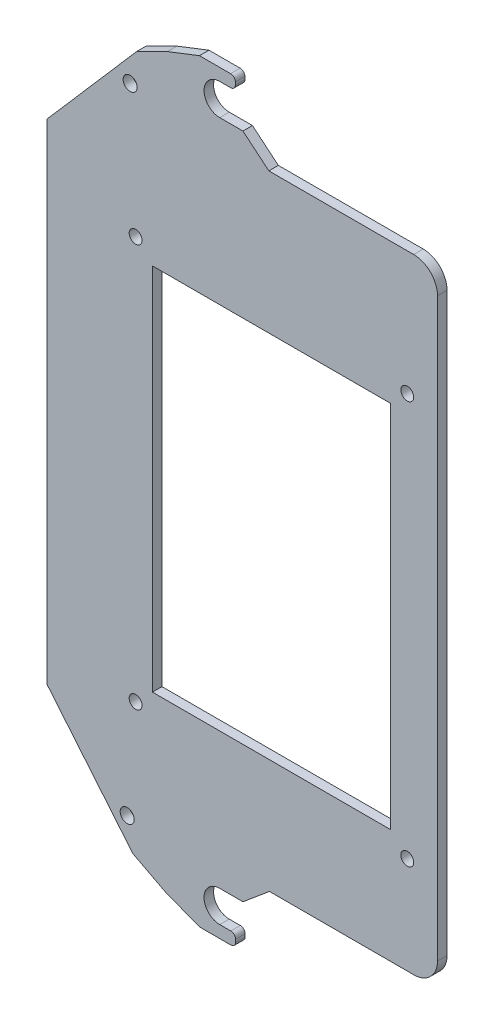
from build123d import *

# Parameters (mm, degrees)
SKETCH1_R           = 1.5
BOSS_EXTRUDE1_DEPTH = 2.032
SKETCH2_R           = 1.375000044
SKETCH2_W           = 24.212268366
SKETCH2_H           = 140.086111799
SKETCH2_W_2         = 50.815795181
SKETCH2_H_2         = 78.815795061
CUT_EXTRUDE1_DEPTH  = 2.032
FILLET1_R           = 5.08
FILLET2_R           = 5.08
FILLET3_R           = 1.016
FILLET4_R           = 1.016
FILLET5_R           = 1.016
FILLET6_R           = 1.016


with BuildPart() as part:
    # Sketch1 → Boss-Extrude1 (new body)
    with BuildSketch(Plane.XY):
        with BuildLine():
            Line((10876.797630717, 3497.975943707), (10882.323986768, 3493.3734144))
            Line((10882.323986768, 3493.3734144), (10939.970073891, 3493.3734144))
            Line((10939.970073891, 3493.3734144), (10939.970073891, 3360.1918064))
            Line((10939.970073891, 3360.1918064), (10882.455998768, 3360.1918064))
            Line((10882.455998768, 3360.1918064), (10876.797630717, 3355.460396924))
            Line((10876.797630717, 3355.460396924), (10871.835598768, 3355.456258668))
            ThreePointArc((10871.835598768, 3355.456258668), (10868.489142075, 3352.109801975), (10871.835598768, 3348.763345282))
            Line((10871.835598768, 3348.763345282), (10875.239912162, 3348.763345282))
            Line((10875.239912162, 3348.763345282), (10875.239912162, 3346.164921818))
            Line((10875.239912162, 3346.164921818), (10867.511043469, 3346.164921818))
            Line((10867.511043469, 3346.164921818), (10860.222293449, 3348.994002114))
            Line((10860.222293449, 3348.994002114), (10853.278243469, 3352.619292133))
            Line((10853.278243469, 3352.619292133), (10834.952955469, 3374.757680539))
            Line((10834.952955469, 3374.757680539), (10834.952955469, 3479.264804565))
            Line((10834.952955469, 3479.264804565), (10854.100493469, 3501.331022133))
            Line((10854.100493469, 3501.331022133), (10854.115043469, 3501.342792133))
            Line((10854.115043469, 3501.342792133), (10860.667528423, 3504.603768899))
            Line((10860.667528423, 3504.603768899), (10867.511043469, 3507.267537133))
            Line((10867.511043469, 3507.267537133), (10875.045942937, 3507.267537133))
            Line((10875.045942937, 3507.267537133), (10875.182055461, 3507.267537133))
            Line((10875.182055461, 3507.267537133), (10875.182055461, 3504.668857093))
            Line((10875.182055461, 3504.668857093), (10871.835598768, 3504.668857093))
            ThreePointArc((10871.835598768, 3504.668857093), (10868.489142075, 3501.3224004), (10871.835598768, 3497.975943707))
            Line((10871.835598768, 3497.975943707), (10876.797630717, 3497.975943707))
        make_face()
        with Locations((10852.711352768, 3494.7484304)):
            Circle(SKETCH1_R, mode=Mode.SUBTRACT)
        with Locations((10852.082024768, 3359.0401704)):
            Circle(SKETCH1_R, mode=Mode.SUBTRACT)
    extrude(amount=BOSS_EXTRUDE1_DEPTH)

    # Sketch2 → Cut-Extrude1 (cut)
    with BuildSketch(Plane(origin=(0, 0, 0), x_dir=(-1, 0, 0), z_dir=(0, 0, -1))):
        with Locations((-10853.885250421, 3466.970292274)):
            Circle(SKETCH2_R)
        with Locations((-10911.885250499, 3466.970292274)):
            Circle(SKETCH2_R)
        with Locations((-10911.885250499, 3380.970292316)):
            Circle(SKETCH2_R)
        with Locations((-10853.885250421, 3380.970292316)):
            Circle(SKETCH2_R)
        with Locations((-10930.446384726, 3425.710458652)):
            Rectangle(SKETCH2_W, SKETCH2_H)
        with Locations((-10882.885250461, 3423.970292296)):
            Rectangle(SKETCH2_W_2, SKETCH2_H_2)
    extrude(amount=-CUT_EXTRUDE1_DEPTH, mode=Mode.SUBTRACT)

    # Fillet1
    fillet1_edges = [part.edges().sort_by_distance(p)[0] for p in [
        (10918.340250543, 3493.3734144, 1.016),
    ]]
    fillet(fillet1_edges, radius=FILLET1_R)

    # Fillet2
    fillet2_edges = [part.edges().sort_by_distance(p)[0] for p in [
        (10918.340250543, 3360.1918064, 1.016),
    ]]
    fillet(fillet2_edges, radius=FILLET2_R)

    # Fillet3
    fillet3_edges = [part.edges().sort_by_distance(p)[0] for p in [
        (10875.239912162, 3346.164921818, 1.016),
    ]]
    fillet(fillet3_edges, radius=FILLET3_R)

    # Fillet4
    fillet4_edges = [part.edges().sort_by_distance(p)[0] for p in [
        (10875.239912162, 3348.763345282, 1.016),
    ]]
    fillet(fillet4_edges, radius=FILLET4_R)

    # Fillet5
    fillet5_edges = [part.edges().sort_by_distance(p)[0] for p in [
        (10875.182055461, 3504.668857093, 1.016),
    ]]
    fillet(fillet5_edges, radius=FILLET5_R)

    # Fillet6
    fillet6_edges = [part.edges().sort_by_distance(p)[0] for p in [
        (10875.182055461, 3507.267537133, 1.016),
    ]]
    fillet(fillet6_edges, radius=FILLET6_R)


solid = part.part
